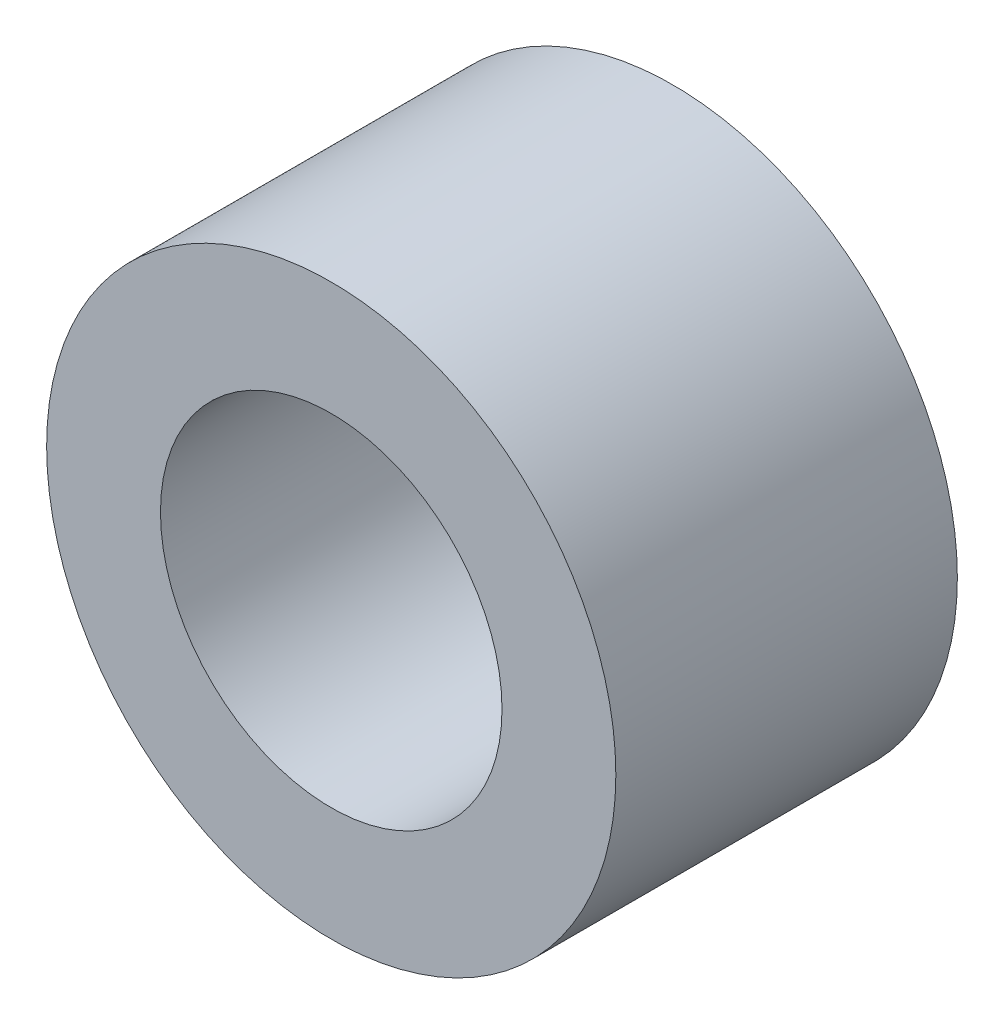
from build123d import *

# Parameters (mm, degrees)
BASE_EXTRUSION_DEPTH      = 1.5
BASE_EXTRUSION_DEPTH_BACK = 1.5
ESQUISSE1_R               = 2.5
ESQUISSE1_R_2             = 1.5


with BuildPart() as part:
    # Esquisse1 → Base-Extrusion (new, two sides: drawn at the far end of the back side and taken through both)
    with BuildSketch(Plane.XY.offset(-BASE_EXTRUSION_DEPTH_BACK)):
        with Locations((0, 15)):
            Circle(ESQUISSE1_R)
        with Locations((0, 15)):
            Circle(ESQUISSE1_R_2, mode=Mode.SUBTRACT)
    extrude(amount=BASE_EXTRUSION_DEPTH + BASE_EXTRUSION_DEPTH_BACK)


solid = part.part
